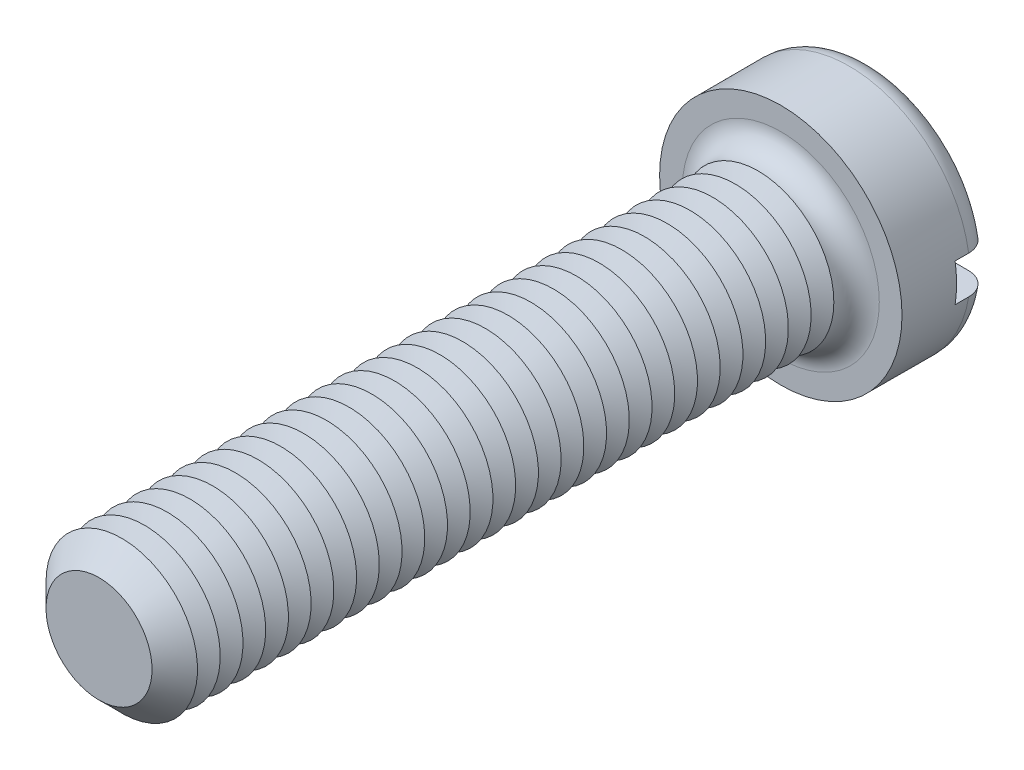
from build123d import *

# Parameters (mm, degrees)
SKETCH3_R           = 8
BOSS_EXTRUDE2_DEPTH = 6
SKETCH4_R           = 5
BOSS_EXTRUDE3_DEPTH = 45
FILLET1_R           = 1.5
CHAMFER1_SIZE       = 1.5
LPATTERN1_COUNT     = 28
LPATTERN1_PITCH     = 1.5
SKETCH8_W           = 16
SKETCH8_H           = 2.5
CUT_EXTRUDE1_DEPTH  = 2.4


with BuildPart() as part:
    # Sketch3 → Boss-Extrude2 (new body)
    with BuildSketch(Plane.XY):
        Circle(SKETCH3_R)
    extrude(amount=-BOSS_EXTRUDE2_DEPTH)

    # Sketch4 → Boss-Extrude3 (add)
    with BuildSketch(Plane.XY):
        with Locations(Location((0, 0, 0), (0, 0, 180))):
            Circle(SKETCH4_R)
    extrude(amount=BOSS_EXTRUDE3_DEPTH)

    # Fillet1
    fillet1_edges = [part.edges().sort_by_distance(p)[0] for p in [
        (-8, 0, -6),
        (5, 0, 0),
    ]]
    fillet(fillet1_edges, radius=FILLET1_R)

    # Chamfer1
    chamfer1_edges = [part.edges().sort_by_distance(p)[0] for p in [
        (5, 0, 45),
    ]]
    chamfer(chamfer1_edges, length=CHAMFER1_SIZE)

    # Sketch6 → Cut-Revolve1 (revolve, cut)
    with BuildSketch(Plane(origin=(0, 0, 0), x_dir=(0, 0, -1), z_dir=(1, 0, 0)), mode=Mode.PRIVATE) as cut_revolve1_sk:
        Polygon((-1.5, 5), (-2.25, 3.700961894), (-3, 5), align=None)
    cut_revolve1 = revolve(cut_revolve1_sk.sketch.rotate(Axis((0, 0, -1.694361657), (0, 0, 1)), 90), axis=Axis((0, 0, -1.694361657), (0, 0, 1)), mode=Mode.SUBTRACT)

    # LPattern1: Cut-Revolve1 ×28
    with Locations(*[(0, 0, i * LPATTERN1_PITCH) for i in range(1, LPATTERN1_COUNT)]):
        add(cut_revolve1, mode=Mode.SUBTRACT)

    # Sketch8 → Cut-Extrude1 (cut)
    with BuildSketch(Plane(origin=(0, 0, -6), x_dir=(-1, 0, 0), z_dir=(0, 0, -1))):
        Rectangle(SKETCH8_W, SKETCH8_H)
    extrude(amount=-CUT_EXTRUDE1_DEPTH, mode=Mode.SUBTRACT)


solid = part.part
